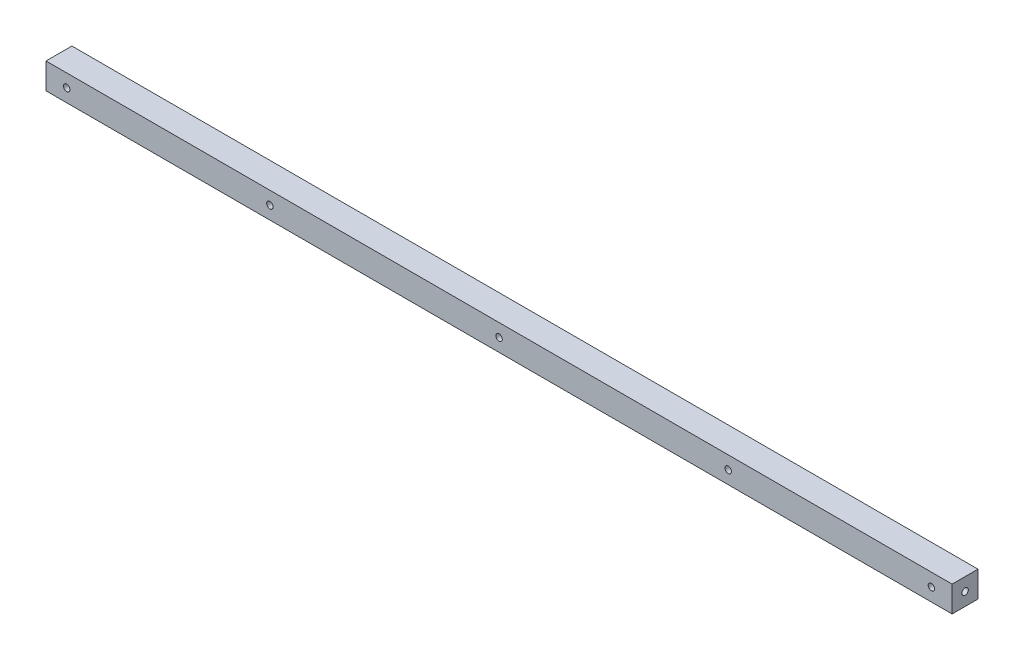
from build123d import *

# Parameters (mm, degrees)
ESQUISSE1_W               = 20
ESQUISSE1_H               = 20
EXTRUSION1_DEPTH          = 350
TROU_TARAUD_M6X1_01_D     = 5
TROU_TARAUD_M6X1_02_D     = 5
TROU_TARAUD_M6X1_02_DEPTH = 20
TROU_TARAUD_M6X1_02_TIP   = 1.502151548
TROU_TARAUD_M6X1_03_D     = 5
TROU_TARAUD_M6X1_03_DEPTH = 20
TROU_TARAUD_M6X1_03_TIP   = 1.502151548


with BuildPart() as part:
    # Esquisse1 → Extrusion1 (new, symmetric)
    with BuildSketch(Plane(origin=(0, 0, 0), x_dir=(0, 0, -1), z_dir=(1, 0, 0))):
        Rectangle(ESQUISSE1_W, ESQUISSE1_H)
    extrude(amount=EXTRUSION1_DEPTH, both=True)

    # Trou taraud_ M6x1.01 (through all)
    with Locations(Plane.XY.offset(10)):
        with Locations((-334, 0), (-177, 0), (0, 0), (177, 0), (334, 0)):
            Hole(TROU_TARAUD_M6X1_01_D / 2)

    # Trou taraud_ M6x1.02
    with Locations(Plane.ZY.offset(350)):
        with Locations((0, 0)):
            Hole(TROU_TARAUD_M6X1_02_D / 2, depth=TROU_TARAUD_M6X1_02_DEPTH)
            with Locations((0, 0, -(TROU_TARAUD_M6X1_02_DEPTH + TROU_TARAUD_M6X1_02_TIP / 2))):  # 118° drill point
                Cone(0, TROU_TARAUD_M6X1_02_D / 2, TROU_TARAUD_M6X1_02_TIP, mode=Mode.SUBTRACT)

    # Trou taraud_ M6x1.03
    with Locations(Plane(origin=(350, 0, 0), x_dir=(0, 0, -1), z_dir=(1, 0, 0))):
        with Locations((0, 0)):
            Hole(TROU_TARAUD_M6X1_03_D / 2, depth=TROU_TARAUD_M6X1_03_DEPTH)
            with Locations((0, 0, -(TROU_TARAUD_M6X1_03_DEPTH + TROU_TARAUD_M6X1_03_TIP / 2))):  # 118° drill point
                Cone(0, TROU_TARAUD_M6X1_03_D / 2, TROU_TARAUD_M6X1_03_TIP, mode=Mode.SUBTRACT)


solid = part.part
